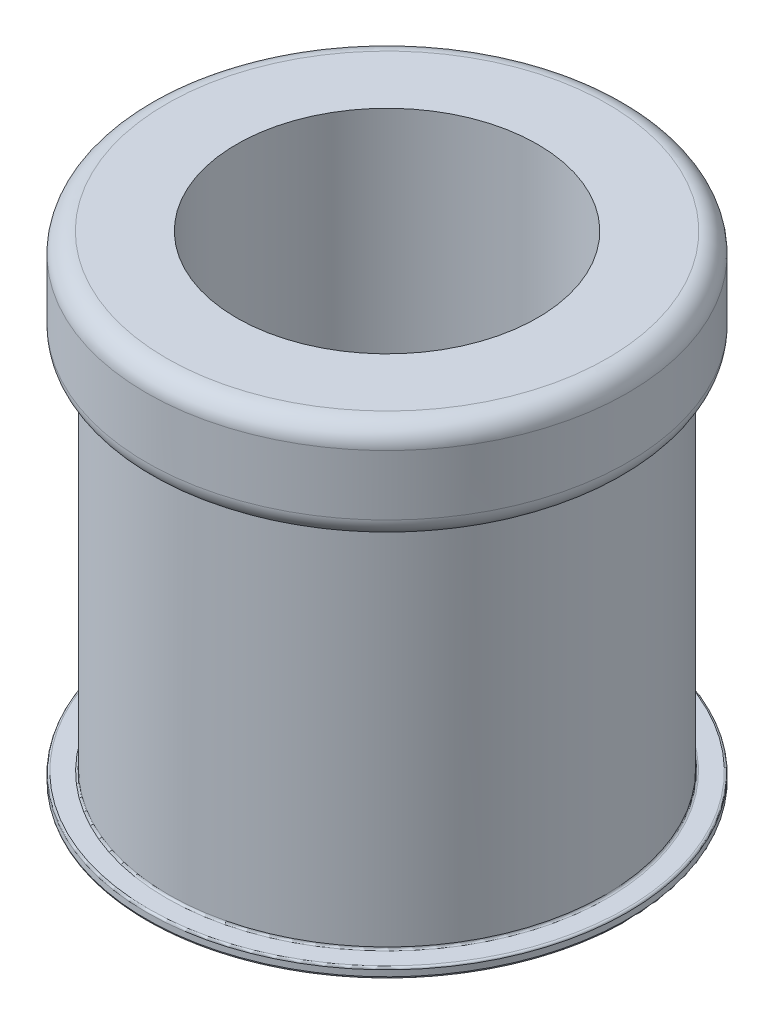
ISO-10303-21;
HEADER;
FILE_DESCRIPTION(('STEP AP214'),'2;1');
FILE_NAME('part.step','',(''),(''),'','','');
FILE_SCHEMA(('AUTOMOTIVE_DESIGN { 1 0 10303 214 1 1 1 1 }'));
ENDSEC;
DATA;
#1=APPLICATION_CONTEXT('core data for automotive mechanical design processes');
#2=APPLICATION_PROTOCOL_DEFINITION('international standard','automotive_design',2000,#1);
#3=PRODUCT_CONTEXT('',#1,'mechanical');
#4=PRODUCT('Part','Part','',(#3));
#5=PRODUCT_RELATED_PRODUCT_CATEGORY('part','',(#4));
#6=PRODUCT_DEFINITION_FORMATION('','',#4);
#7=PRODUCT_DEFINITION_CONTEXT('part definition',#1,'design');
#8=PRODUCT_DEFINITION('design','',#6,#7);
#9=PRODUCT_DEFINITION_SHAPE('','',#8);
#10=(LENGTH_UNIT() NAMED_UNIT(*) SI_UNIT(.MILLI.,.METRE.));
#11=(NAMED_UNIT(*) PLANE_ANGLE_UNIT() SI_UNIT($,.RADIAN.));
#12=(NAMED_UNIT(*) SI_UNIT($,.STERADIAN.) SOLID_ANGLE_UNIT());
#13=UNCERTAINTY_MEASURE_WITH_UNIT(LENGTH_MEASURE(1.E-05),#10,'distance_accuracy_value','');
#14=(GEOMETRIC_REPRESENTATION_CONTEXT(3) GLOBAL_UNCERTAINTY_ASSIGNED_CONTEXT((#13)) GLOBAL_UNIT_ASSIGNED_CONTEXT((#10,
#11,#12)) REPRESENTATION_CONTEXT('',''));
#15=CARTESIAN_POINT('',(0.,0.,0.));
#16=DIRECTION('',(0.,0.,1.));
#17=DIRECTION('',(1.,0.,0.));
#18=AXIS2_PLACEMENT_3D('',#15,#16,#17);
#19=CARTESIAN_POINT('',(0.,0.,0.));
#20=DIRECTION('',(0.,-1.,0.));
#21=DIRECTION('',(0.,0.,-1.));
#22=AXIS2_PLACEMENT_3D('',#19,#20,#21);
#23=PLANE('',#22);
#24=CARTESIAN_POINT('',(0.,0.,0.));
#25=DIRECTION('',(0.,-1.,0.));
#26=DIRECTION('',(0.,0.,-1.));
#27=AXIS2_PLACEMENT_3D('',#24,#25,#26);
#28=CIRCLE('',#27,15.1003);
#29=CARTESIAN_POINT('',(0.,0.,-15.1003));
#30=VERTEX_POINT('',#29);
#31=EDGE_CURVE('E56',#30,#30,#28,.T.);
#32=ORIENTED_EDGE('',*,*,#31,.T.);
#33=EDGE_LOOP('',(#32));
#34=FACE_BOUND('',#33,.T.);
#35=CARTESIAN_POINT('',(0.,0.,0.));
#36=DIRECTION('',(0.,1.,0.));
#37=DIRECTION('',(0.,0.,1.));
#38=AXIS2_PLACEMENT_3D('',#35,#36,#37);
#39=CIRCLE('',#38,9.525);
#40=CARTESIAN_POINT('',(0.,0.,9.525));
#41=VERTEX_POINT('',#40);
#42=EDGE_CURVE('E74',#41,#41,#39,.T.);
#43=ORIENTED_EDGE('',*,*,#42,.T.);
#44=EDGE_LOOP('',(#43));
#45=FACE_BOUND('',#44,.T.);
#46=ADVANCED_FACE('F34',(#34,#45),#23,.T.);
#47=CARTESIAN_POINT('',(0.,0.,0.));
#48=DIRECTION('',(0.,-1.,0.));
#49=DIRECTION('',(0.,0.,-1.));
#50=AXIS2_PLACEMENT_3D('',#47,#48,#49);
#51=CYLINDRICAL_SURFACE('',#50,15.2273);
#52=CARTESIAN_POINT('',(0.,0.127,0.));
#53=DIRECTION('',(0.,-1.,0.));
#54=DIRECTION('',(0.,0.,-1.));
#55=AXIS2_PLACEMENT_3D('',#52,#53,#54);
#56=CIRCLE('',#55,15.2273);
#57=CARTESIAN_POINT('',(0.,0.127,-15.2273));
#58=VERTEX_POINT('',#57);
#59=EDGE_CURVE('E48',#58,#58,#56,.F.);
#60=ORIENTED_EDGE('',*,*,#59,.T.);
#61=EDGE_LOOP('',(#60));
#62=FACE_BOUND('',#61,.T.);
#63=CARTESIAN_POINT('',(0.,0.508,0.));
#64=DIRECTION('',(0.,1.,0.));
#65=DIRECTION('',(0.,0.,1.));
#66=AXIS2_PLACEMENT_3D('',#63,#64,#65);
#67=CIRCLE('',#66,15.2273);
#68=CARTESIAN_POINT('',(0.,0.508,15.2273));
#69=VERTEX_POINT('',#68);
#70=EDGE_CURVE('E53',#69,#69,#67,.F.);
#71=ORIENTED_EDGE('',*,*,#70,.T.);
#72=EDGE_LOOP('',(#71));
#73=FACE_BOUND('',#72,.T.);
#74=ADVANCED_FACE('F120',(#62,#73),#51,.T.);
#75=CARTESIAN_POINT('',(0.,0.635,-15.2273));
#76=DIRECTION('',(0.,1.,0.));
#77=DIRECTION('',(0.,0.,1.));
#78=AXIS2_PLACEMENT_3D('',#75,#76,#77);
#79=PLANE('',#78);
#80=CARTESIAN_POINT('',(0.,0.635,0.));
#81=DIRECTION('',(0.,1.,0.));
#82=DIRECTION('',(0.,0.,1.));
#83=AXIS2_PLACEMENT_3D('',#80,#81,#82);
#84=CIRCLE('',#83,15.1003);
#85=CARTESIAN_POINT('',(0.,0.635,15.1003));
#86=VERTEX_POINT('',#85);
#87=EDGE_CURVE('E40',#86,#86,#84,.T.);
#88=ORIENTED_EDGE('',*,*,#87,.T.);
#89=EDGE_LOOP('',(#88));
#90=FACE_BOUND('',#89,.T.);
#91=CARTESIAN_POINT('',(0.,0.635,0.));
#92=DIRECTION('',(0.,1.,0.));
#93=DIRECTION('',(0.,0.,1.));
#94=AXIS2_PLACEMENT_3D('',#91,#92,#93);
#95=CIRCLE('',#94,13.9454378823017);
#96=CARTESIAN_POINT('',(0.,0.635,13.9454378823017));
#97=VERTEX_POINT('',#96);
#98=EDGE_CURVE('E44',#97,#97,#95,.F.);
#99=ORIENTED_EDGE('',*,*,#98,.T.);
#100=EDGE_LOOP('',(#99));
#101=FACE_BOUND('',#100,.T.);
#102=ADVANCED_FACE('F115',(#90,#101),#79,.T.);
#103=CARTESIAN_POINT('',(0.,0.,0.));
#104=DIRECTION('',(0.,-1.,0.));
#105=DIRECTION('',(0.,0.,-1.));
#106=AXIS2_PLACEMENT_3D('',#103,#104,#105);
#107=CYLINDRICAL_SURFACE('',#106,13.8184378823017);
#108=CARTESIAN_POINT('',(0.,0.762,0.));
#109=DIRECTION('',(0.,1.,0.));
#110=DIRECTION('',(0.,0.,1.));
#111=AXIS2_PLACEMENT_3D('',#108,#109,#110);
#112=CIRCLE('',#111,13.8184378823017);
#113=CARTESIAN_POINT('',(0.,0.762,13.8184378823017));
#114=VERTEX_POINT('',#113);
#115=EDGE_CURVE('E10',#114,#114,#112,.T.);
#116=ORIENTED_EDGE('',*,*,#115,.T.);
#117=EDGE_LOOP('',(#116));
#118=FACE_BOUND('',#117,.T.);
#119=CARTESIAN_POINT('',(0.,23.9014,0.));
#120=DIRECTION('',(0.,-1.,0.));
#121=DIRECTION('',(0.,0.,-1.));
#122=AXIS2_PLACEMENT_3D('',#119,#120,#121);
#123=CIRCLE('',#122,13.8184378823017);
#124=CARTESIAN_POINT('',(0.,23.9014,-13.8184378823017));
#125=VERTEX_POINT('',#124);
#126=EDGE_CURVE('E71',#125,#125,#123,.T.);
#127=ORIENTED_EDGE('',*,*,#126,.T.);
#128=EDGE_LOOP('',(#127));
#129=FACE_BOUND('',#128,.T.);
#130=ADVANCED_FACE('F110',(#118,#129),#107,.T.);
#131=CARTESIAN_POINT('',(0.,23.9014,-13.8184378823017));
#132=DIRECTION('',(0.,-1.,0.));
#133=DIRECTION('',(0.,0.,-1.));
#134=AXIS2_PLACEMENT_3D('',#131,#132,#133);
#135=PLANE('',#134);
#136=CARTESIAN_POINT('',(0.,23.9014,0.));
#137=DIRECTION('',(0.,-1.,0.));
#138=DIRECTION('',(0.,0.,-1.));
#139=AXIS2_PLACEMENT_3D('',#136,#137,#138);
#140=CIRCLE('',#139,13.9573);
#141=CARTESIAN_POINT('',(0.,23.9014,-13.9573));
#142=VERTEX_POINT('',#141);
#143=EDGE_CURVE('E59',#142,#142,#140,.T.);
#144=ORIENTED_EDGE('',*,*,#143,.T.);
#145=EDGE_LOOP('',(#144));
#146=FACE_BOUND('',#145,.T.);
#147=ORIENTED_EDGE('',*,*,#126,.F.);
#148=EDGE_LOOP('',(#147));
#149=FACE_BOUND('',#148,.T.);
#150=ADVANCED_FACE('F99',(#146,#149),#135,.T.);
#151=CARTESIAN_POINT('',(0.,0.,0.));
#152=DIRECTION('',(0.,-1.,0.));
#153=DIRECTION('',(0.,0.,-1.));
#154=AXIS2_PLACEMENT_3D('',#151,#152,#153);
#155=CYLINDRICAL_SURFACE('',#154,15.2273);
#156=CARTESIAN_POINT('',(0.,28.9814,0.));
#157=DIRECTION('',(0.,1.,0.));
#158=DIRECTION('',(0.,0.,1.));
#159=AXIS2_PLACEMENT_3D('',#156,#157,#158);
#160=CIRCLE('',#159,15.2273);
#161=CARTESIAN_POINT('',(0.,28.9814,15.2273));
#162=VERTEX_POINT('',#161);
#163=EDGE_CURVE('E65',#162,#162,#160,.F.);
#164=ORIENTED_EDGE('',*,*,#163,.T.);
#165=EDGE_LOOP('',(#164));
#166=FACE_BOUND('',#165,.T.);
#167=CARTESIAN_POINT('',(0.,25.1714,0.));
#168=DIRECTION('',(0.,-1.,0.));
#169=DIRECTION('',(0.,0.,-1.));
#170=AXIS2_PLACEMENT_3D('',#167,#168,#169);
#171=CIRCLE('',#170,15.2273);
#172=CARTESIAN_POINT('',(0.,25.1714,-15.2273));
#173=VERTEX_POINT('',#172);
#174=EDGE_CURVE('E68',#173,#173,#171,.F.);
#175=ORIENTED_EDGE('',*,*,#174,.T.);
#176=EDGE_LOOP('',(#175));
#177=FACE_BOUND('',#176,.T.);
#178=ADVANCED_FACE('F87',(#166,#177),#155,.T.);
#179=CARTESIAN_POINT('',(0.,30.2514,-15.2273));
#180=DIRECTION('',(0.,1.,0.));
#181=DIRECTION('',(0.,0.,1.));
#182=AXIS2_PLACEMENT_3D('',#179,#180,#181);
#183=PLANE('',#182);
#184=CARTESIAN_POINT('',(0.,30.2514,0.));
#185=DIRECTION('',(0.,1.,0.));
#186=DIRECTION('',(0.,0.,1.));
#187=AXIS2_PLACEMENT_3D('',#184,#185,#186);
#188=CIRCLE('',#187,9.525);
#189=CARTESIAN_POINT('',(0.,30.2514,9.525));
#190=VERTEX_POINT('',#189);
#191=EDGE_CURVE('E77',#190,#190,#188,.T.);
#192=ORIENTED_EDGE('',*,*,#191,.F.);
#193=EDGE_LOOP('',(#192));
#194=FACE_BOUND('',#193,.T.);
#195=CARTESIAN_POINT('',(0.,30.2514,0.));
#196=DIRECTION('',(0.,1.,0.));
#197=DIRECTION('',(0.,0.,1.));
#198=AXIS2_PLACEMENT_3D('',#195,#196,#197);
#199=CIRCLE('',#198,13.9573);
#200=CARTESIAN_POINT('',(0.,30.2514,13.9573));
#201=VERTEX_POINT('',#200);
#202=EDGE_CURVE('E62',#201,#201,#199,.T.);
#203=ORIENTED_EDGE('',*,*,#202,.T.);
#204=EDGE_LOOP('',(#203));
#205=FACE_BOUND('',#204,.T.);
#206=ADVANCED_FACE('F83',(#194,#205),#183,.T.);
#207=CARTESIAN_POINT('',(0.,28.9814,0.));
#208=DIRECTION('',(0.,1.,0.));
#209=DIRECTION('',(0.,0.,1.));
#210=AXIS2_PLACEMENT_3D('',#207,#208,#209);
#211=TOROIDAL_SURFACE('',#210,13.9573,1.27);
#212=ORIENTED_EDGE('',*,*,#202,.F.);
#213=EDGE_LOOP('',(#212));
#214=FACE_BOUND('',#213,.T.);
#215=ORIENTED_EDGE('',*,*,#163,.F.);
#216=EDGE_LOOP('',(#215));
#217=FACE_BOUND('',#216,.T.);
#218=ADVANCED_FACE('F86',(#214,#217),#211,.T.);
#219=CARTESIAN_POINT('',(0.,25.1714,0.));
#220=DIRECTION('',(0.,-1.,0.));
#221=DIRECTION('',(0.,0.,-1.));
#222=AXIS2_PLACEMENT_3D('',#219,#220,#221);
#223=TOROIDAL_SURFACE('',#222,13.9573,1.27);
#224=ORIENTED_EDGE('',*,*,#174,.F.);
#225=EDGE_LOOP('',(#224));
#226=FACE_BOUND('',#225,.T.);
#227=ORIENTED_EDGE('',*,*,#143,.F.);
#228=EDGE_LOOP('',(#227));
#229=FACE_BOUND('',#228,.T.);
#230=ADVANCED_FACE('F93',(#226,#229),#223,.T.);
#231=CARTESIAN_POINT('',(0.,0.,0.));
#232=DIRECTION('',(0.,1.,0.));
#233=DIRECTION('',(0.,0.,1.));
#234=AXIS2_PLACEMENT_3D('',#231,#232,#233);
#235=CYLINDRICAL_SURFACE('',#234,9.525);
#236=ORIENTED_EDGE('',*,*,#42,.F.);
#237=EDGE_LOOP('',(#236));
#238=FACE_BOUND('',#237,.T.);
#239=ORIENTED_EDGE('',*,*,#191,.T.);
#240=EDGE_LOOP('',(#239));
#241=FACE_BOUND('',#240,.T.);
#242=ADVANCED_FACE('F81',(#238,#241),#235,.F.);
#243=CARTESIAN_POINT('',(0.,0.127,0.));
#244=DIRECTION('',(0.,-1.,0.));
#245=DIRECTION('',(0.,0.,-1.));
#246=AXIS2_PLACEMENT_3D('',#243,#244,#245);
#247=TOROIDAL_SURFACE('',#246,15.1003,0.127);
#248=ORIENTED_EDGE('',*,*,#59,.F.);
#249=EDGE_LOOP('',(#248));
#250=FACE_BOUND('',#249,.T.);
#251=ORIENTED_EDGE('',*,*,#31,.F.);
#252=EDGE_LOOP('',(#251));
#253=FACE_BOUND('',#252,.T.);
#254=ADVANCED_FACE('F133',(#250,#253),#247,.T.);
#255=CARTESIAN_POINT('',(0.,0.508,0.));
#256=DIRECTION('',(0.,1.,0.));
#257=DIRECTION('',(0.,0.,1.));
#258=AXIS2_PLACEMENT_3D('',#255,#256,#257);
#259=TOROIDAL_SURFACE('',#258,15.1003,0.127);
#260=ORIENTED_EDGE('',*,*,#87,.F.);
#261=EDGE_LOOP('',(#260));
#262=FACE_BOUND('',#261,.T.);
#263=ORIENTED_EDGE('',*,*,#70,.F.);
#264=EDGE_LOOP('',(#263));
#265=FACE_BOUND('',#264,.T.);
#266=ADVANCED_FACE('F138',(#262,#265),#259,.T.);
#267=CARTESIAN_POINT('',(0.,0.762,0.));
#268=DIRECTION('',(0.,1.,0.));
#269=DIRECTION('',(0.,0.,1.));
#270=AXIS2_PLACEMENT_3D('',#267,#268,#269);
#271=TOROIDAL_SURFACE('',#270,13.9454378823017,0.127);
#272=ORIENTED_EDGE('',*,*,#115,.F.);
#273=EDGE_LOOP('',(#272));
#274=FACE_BOUND('',#273,.T.);
#275=ORIENTED_EDGE('',*,*,#98,.F.);
#276=EDGE_LOOP('',(#275));
#277=FACE_BOUND('',#276,.T.);
#278=ADVANCED_FACE('F144',(#274,#277),#271,.F.);
#279=CLOSED_SHELL('',(#46,#74,#102,#130,#150,#178,#206,#218,#230,#242,#254,#266,#278));
#280=MANIFOLD_SOLID_BREP('B2',#279);
#281=ADVANCED_BREP_SHAPE_REPRESENTATION('',(#18,#280),#14);
#282=SHAPE_DEFINITION_REPRESENTATION(#9,#281);
ENDSEC;
END-ISO-10303-21;
